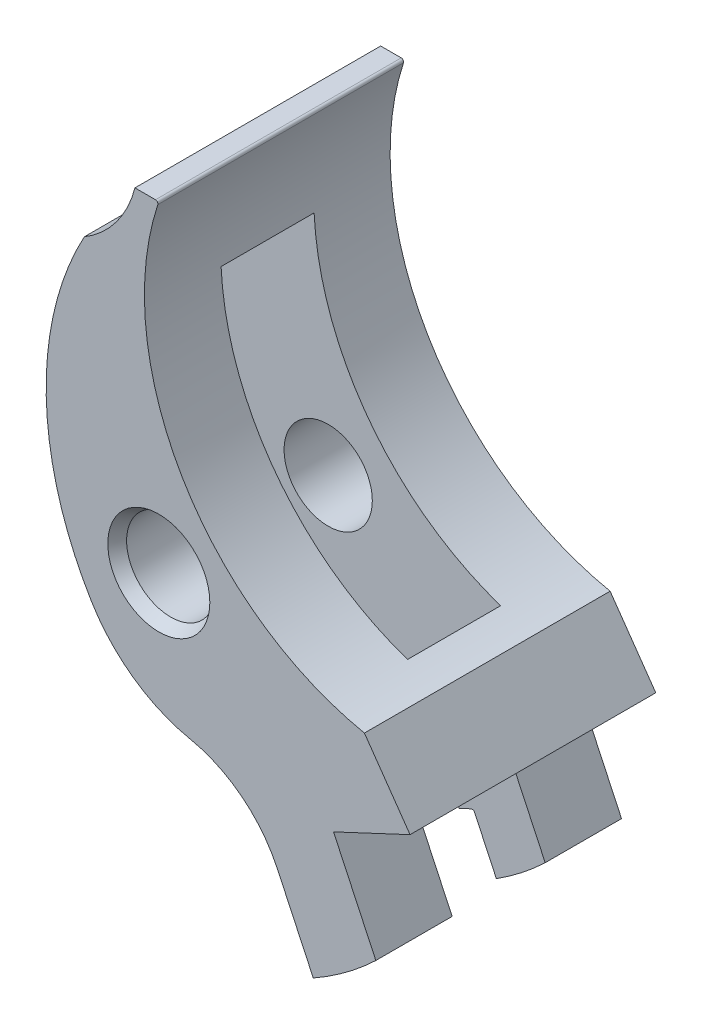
from build123d import *

# Parameters (mm, degrees)
SKETCH1_R           = 1.4097
BOSS_EXTRUDE1_DEPTH = 3.9243
CUT_EXTRUDE1_DEPTH  = 1.4859
CUT_EXTRUDE2_DEPTH  = 1.778
FILLET1_R           = 0.0762
FILLET2_R           = 0.0762


with BuildPart() as part:
    # Sketch1 → Boss-Extrude1 (new, symmetric)
    with BuildSketch(Plane.XY):
        with BuildLine():
            Line((4.933743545, -8.736089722), (3.788914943, -6.292142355))
            ThreePointArc((3.788914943, -6.292142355), (2.656095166, -4.863071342), (1.00319934, -4.092707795))
            ThreePointArc((1.00319934, -4.092707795), (-0.801041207, -3.31040914), (-2.143396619, -1.873274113))
            ThreePointArc((-2.143396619, -1.873274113), (-3.596288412, 3.087418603), (-2.380022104, 8.111367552))
            ThreePointArc((-2.380022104, 8.111367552), (-1.357644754, 9.033221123), (-0.762, 10.2743))
            Line((-0.762, 10.2743), (0, 10.2743))
            ThreePointArc((0, 10.2743), (0.7102493, 3.085447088), (6.56750447, -1.142628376))
            Line((6.56750447, -1.142628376), (8.025414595, -3.224739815))
            Line((8.025414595, -3.224739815), (5.581074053, -4.369752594))
            Line((5.581074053, -4.369752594), (6.931837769, -7.253324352))
            ThreePointArc((6.931837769, -7.253324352), (5.978934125, -8.056887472), (4.933743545, -8.736089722))
        make_face()
        Circle(SKETCH1_R, mode=Mode.SUBTRACT)
    extrude(amount=BOSS_EXTRUDE1_DEPTH, both=True)

    # Sketch2 → Cut-Extrude1 (cut, symmetric)
    with BuildSketch(Plane.XY):
        with BuildLine():
            Line((6.157484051, -4.099742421), (5.953465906, -3.808374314))
            ThreePointArc((5.953465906, -3.808374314), (3.524721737, 3.353543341), (-2.434978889, 8.00905955))
            Line((-2.434978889, 8.00905955), (-5.600203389, 10.738486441))
            Line((-5.600203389, 10.738486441), (-12.369227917, 4.11600703))
            Line((-12.369227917, 4.11600703), (-5.600203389, -19.092872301))
            Line((-5.600203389, -19.092872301), (9.804546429, -11.468235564))
            Line((9.804546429, -11.468235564), (6.157484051, -4.099742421))
        make_face()
    extrude(amount=CUT_EXTRUDE1_DEPTH, both=True, mode=Mode.SUBTRACT)

    # Sketch3 → Cut-Revolve1 (revolve, cut)
    with BuildSketch(Plane(origin=(0, 0, 0), x_dir=(0, 0, -1), z_dir=(1, 0, 0)), mode=Mode.PRIVATE) as cut_revolve1_sk:
        Polygon((3.5433, 1.4097), (3.9243, 1.629670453), (3.9243, 1.344223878), (3.429892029, 1.344223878), align=None)
        Polygon((-3.429892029, 1.344223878), (-3.5433, 1.4097), (-3.9243, 1.629670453), (-3.9243, 1.344223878), align=None)
    revolve(cut_revolve1_sk.sketch.rotate(Axis((0, 0, 0), (0, 0, -1)), 90), axis=Axis((0, 0, 0), (0, 0, -1)), mode=Mode.SUBTRACT)

    # Sketch4 → Cut-Extrude2 (cut)
    with BuildSketch(Plane(origin=(4.243700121, -9.059329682, 0), x_dir=(0.9055687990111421, 0.4241994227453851, 0), z_dir=(0.424199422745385, -0.905568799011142, 0))):
        Polygon((0.762, 1.9939), (1.500213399, 1.255686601), (0.530519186, 1.255686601), (0.530519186, 1.9939), align=None)
        Polygon((1.550780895, -1.205119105), (0.762, -1.9939), (0.578811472, -1.9939), (0.578811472, -1.205119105), align=None)
    extrude(amount=-CUT_EXTRUDE2_DEPTH, mode=Mode.SUBTRACT)

    # Fillet1
    fillet1_edges = [part.edges().sort_by_distance(p)[0] for p in [
        (0, 10.2743, 0),
    ]]
    fillet(fillet1_edges, radius=FILLET1_R)

    # Fillet2
    fillet2_edges = [part.edges().sort_by_distance(p)[0] for p in [
        (4.409531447, -7.018241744, 1.7399),
        (4.409531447, -7.018241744, -1.7399),
    ]]
    fillet(fillet2_edges, radius=FILLET2_R)


solid = part.part
